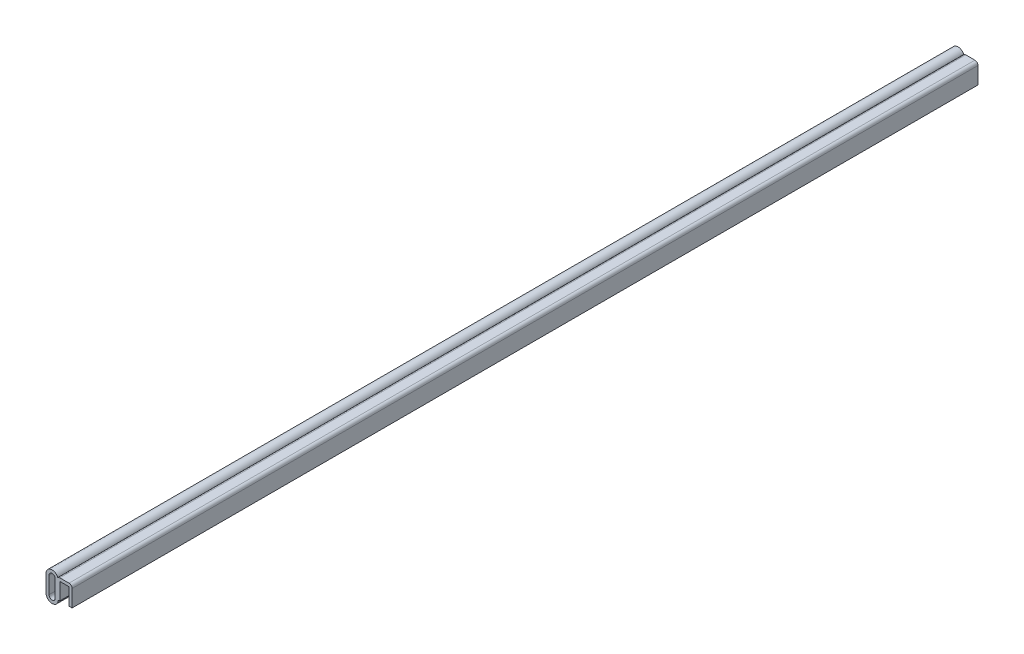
from build123d import *

# Parameters (mm, degrees)
EXTRU_MINCE1_DEPTH = 295
CONG_1_R           = 2
BOSS_EXTRU_1_DEPTH = 295


with BuildPart() as part:
    # Esquisse1 → Extru.-Mince1 (new, symmetric)
    with BuildSketch(Plane.XY):
        Polygon((-5, -6.5), (-5, 6.5), (5, 6.5), (5, -6.5), (3, -6.5), (3, 4.5), (-3, 4.5), (-3, -6.5), align=None)
    extrude(amount=EXTRU_MINCE1_DEPTH, both=True)

    # Cong_1
    cong_1_edges = [part.edges().sort_by_distance(p)[0] for p in [
        (-5, 6.5, 0),
        (5, 6.5, 0),
    ]]
    fillet(cong_1_edges, radius=CONG_1_R)

    # Esquisse2 → Boss.-Extru.1 (add, symmetric)
    with BuildSketch(Plane.XY):
        with BuildLine():
            Line((-4, 4.5), (-4, -6.5))
            ThreePointArc((-4, -6.5), (-8, -10.5), (-12, -6.5))
            Line((-12, -6.5), (-12, 4.5))
            ThreePointArc((-12, 4.5), (-8, 8.5), (-4, 4.5))
        make_face()
        with BuildLine():
            Line((-6, 4.5), (-6, -6.5))
            ThreePointArc((-6, -6.5), (-8, -8.5), (-10, -6.5))
            Line((-10, -6.5), (-10, 4.5))
            ThreePointArc((-10, 4.5), (-8, 6.5), (-6, 4.5))
        make_face(mode=Mode.SUBTRACT)
    extrude(amount=BOSS_EXTRU_1_DEPTH, both=True)


solid = part.part
